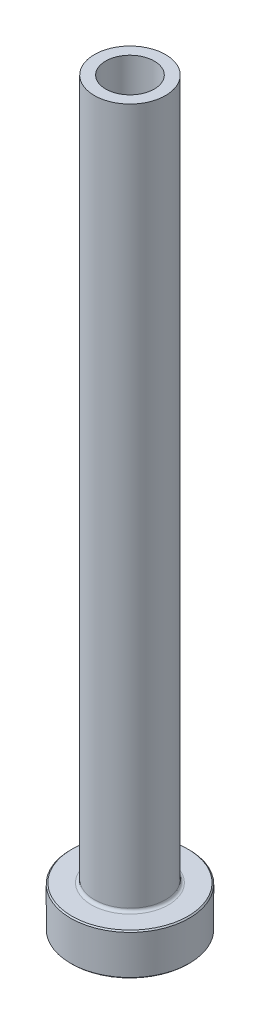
from build123d import *

# Parameters (mm, degrees)
FILLET1_R     = 0.5
CHAMFER1_SIZE = 0.2
CHAMFER3_SIZE = 0.5


with BuildPart() as part:
    # Sketch1 → Revolve1 (revolve)
    with BuildSketch(Plane.XY, mode=Mode.PRIVATE) as revolve1_sk:
        Polygon((-4.1, 125), (-6, 125), (-6, 7), (-10, 7), (-10, 0), (-4.35, 0), (-4.35, 68), (-4.1, 80), align=None)
    revolve(revolve1_sk.sketch.rotate(Axis((0, 92.187680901, 0), (0, -1, 0)), 270), axis=Axis((0, 92.187680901, 0), (0, -1, 0)))

    # Fillet1
    fillet1_edges = [part.edges().sort_by_distance(p)[0] for p in [
        (0, 7, -6),
    ]]
    fillet(fillet1_edges, radius=FILLET1_R)

    # Chamfer1
    chamfer1_edges = [part.edges().sort_by_distance(p)[0] for p in [
        (0, 0, -10),
        (0, 7, -10),
    ]]
    chamfer(chamfer1_edges, length=CHAMFER1_SIZE)

    # Chamfer3
    chamfer3_edges = [part.edges().sort_by_distance(p)[0] for p in [
        (0, 0, -4.35),
    ]]
    chamfer(chamfer3_edges, length=CHAMFER3_SIZE)


solid = part.part
